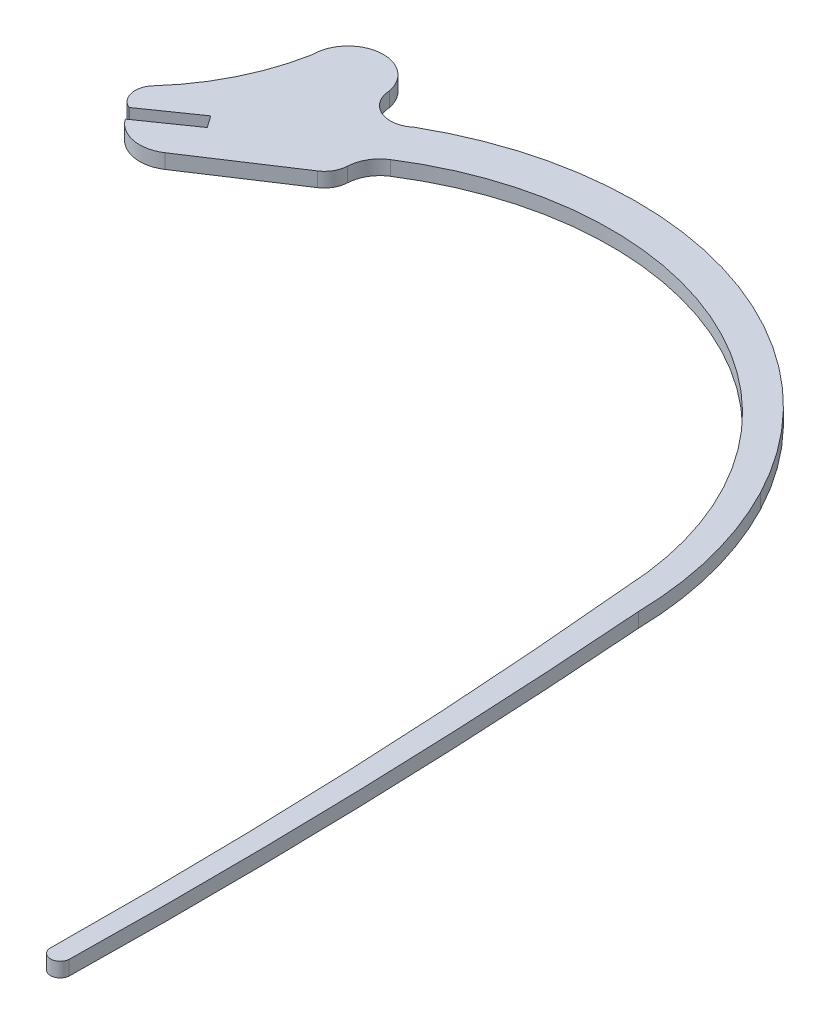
ISO-10303-21;
HEADER;
FILE_DESCRIPTION(('STEP AP214'),'2;1');
FILE_NAME('part.step','',(''),(''),'','','');
FILE_SCHEMA(('AUTOMOTIVE_DESIGN { 1 0 10303 214 1 1 1 1 }'));
ENDSEC;
DATA;
#1=APPLICATION_CONTEXT('core data for automotive mechanical design processes');
#2=APPLICATION_PROTOCOL_DEFINITION('international standard','automotive_design',2000,#1);
#3=PRODUCT_CONTEXT('',#1,'mechanical');
#4=PRODUCT('Part','Part','',(#3));
#5=PRODUCT_RELATED_PRODUCT_CATEGORY('part','',(#4));
#6=PRODUCT_DEFINITION_FORMATION('','',#4);
#7=PRODUCT_DEFINITION_CONTEXT('part definition',#1,'design');
#8=PRODUCT_DEFINITION('design','',#6,#7);
#9=PRODUCT_DEFINITION_SHAPE('','',#8);
#10=(LENGTH_UNIT() NAMED_UNIT(*) SI_UNIT(.MILLI.,.METRE.));
#11=(NAMED_UNIT(*) PLANE_ANGLE_UNIT() SI_UNIT($,.RADIAN.));
#12=(NAMED_UNIT(*) SI_UNIT($,.STERADIAN.) SOLID_ANGLE_UNIT());
#13=UNCERTAINTY_MEASURE_WITH_UNIT(LENGTH_MEASURE(1.E-05),#10,'distance_accuracy_value','');
#14=(GEOMETRIC_REPRESENTATION_CONTEXT(3) GLOBAL_UNCERTAINTY_ASSIGNED_CONTEXT((#13)) GLOBAL_UNIT_ASSIGNED_CONTEXT((#10,
#11,#12)) REPRESENTATION_CONTEXT('',''));
#15=CARTESIAN_POINT('',(0.,0.,0.));
#16=DIRECTION('',(0.,0.,1.));
#17=DIRECTION('',(1.,0.,0.));
#18=AXIS2_PLACEMENT_3D('',#15,#16,#17);
#19=CARTESIAN_POINT('',(-41890.0776006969,3.,-18429.1678708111));
#20=DIRECTION('',(0.,-1.,0.));
#21=DIRECTION('',(0.,0.,-1.));
#22=AXIS2_PLACEMENT_3D('',#19,#20,#21);
#23=CYLINDRICAL_SURFACE('',#22,7.45792893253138);
#24=CARTESIAN_POINT('',(-41890.0776006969,0.,-18429.1678708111));
#25=DIRECTION('',(0.,1.,0.));
#26=DIRECTION('',(0.,0.,1.));
#27=AXIS2_PLACEMENT_3D('',#24,#25,#26);
#28=CIRCLE('',#27,7.45792893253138);
#29=CARTESIAN_POINT('',(-41896.148437,0.,-18424.835937));
#30=VERTEX_POINT('',#29);
#31=CARTESIAN_POINT('',(-41885.984375,0.,-18422.933594));
#32=VERTEX_POINT('',#31);
#33=EDGE_CURVE('E186',#30,#32,#28,.T.);
#34=ORIENTED_EDGE('',*,*,#33,.T.);
#35=DIRECTION('',(0.,-1.,0.));
#36=VECTOR('',#35,1.);
#37=CARTESIAN_POINT('',(-41885.984375,3.,-18422.933594));
#38=LINE('',#37,#36);
#39=CARTESIAN_POINT('',(-41885.984375,3.,-18422.933594));
#40=VERTEX_POINT('',#39);
#41=EDGE_CURVE('E11',#40,#32,#38,.T.);
#42=ORIENTED_EDGE('',*,*,#41,.F.);
#43=CARTESIAN_POINT('',(-41890.0776006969,3.,-18429.1678708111));
#44=DIRECTION('',(0.,1.,0.));
#45=DIRECTION('',(0.,0.,1.));
#46=AXIS2_PLACEMENT_3D('',#43,#44,#45);
#47=CIRCLE('',#46,7.45792893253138);
#48=CARTESIAN_POINT('',(-41896.148437,3.,-18424.835937));
#49=VERTEX_POINT('',#48);
#50=EDGE_CURVE('E218',#49,#40,#47,.T.);
#51=ORIENTED_EDGE('',*,*,#50,.F.);
#52=DIRECTION('',(0.,-1.,0.));
#53=VECTOR('',#52,1.);
#54=CARTESIAN_POINT('',(-41896.148437,3.,-18424.835937));
#55=LINE('',#54,#53);
#56=EDGE_CURVE('E182',#49,#30,#55,.T.);
#57=ORIENTED_EDGE('',*,*,#56,.T.);
#58=EDGE_LOOP('',(#34,#42,#51,#57));
#59=FACE_BOUND('',#58,.T.);
#60=ADVANCED_FACE('F36',(#59),#23,.T.);
#61=CARTESIAN_POINT('',(-41866.9795919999,3.,-18435.427652));
#62=DIRECTION('',(-0.549337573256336,0.,-0.835600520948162));
#63=DIRECTION('',(-0.835600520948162,0.,0.549337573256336));
#64=AXIS2_PLACEMENT_3D('',#61,#62,#63);
#65=PLANE('',#64);
#66=DIRECTION('',(0.835600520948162,0.,-0.549337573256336));
#67=VECTOR('',#66,1.);
#68=CARTESIAN_POINT('',(-41866.9795919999,0.,-18435.427652));
#69=LINE('',#68,#67);
#70=CARTESIAN_POINT('',(-41866.979592,0.,-18435.427652));
#71=VERTEX_POINT('',#70);
#72=EDGE_CURVE('E189',#32,#71,#69,.T.);
#73=ORIENTED_EDGE('',*,*,#72,.T.);
#74=DIRECTION('',(0.,-1.,0.));
#75=VECTOR('',#74,1.);
#76=CARTESIAN_POINT('',(-41866.979592,3.,-18435.427652));
#77=LINE('',#76,#75);
#78=CARTESIAN_POINT('',(-41866.979592,3.,-18435.427652));
#79=VERTEX_POINT('',#78);
#80=EDGE_CURVE('E44',#79,#71,#77,.T.);
#81=ORIENTED_EDGE('',*,*,#80,.F.);
#82=DIRECTION('',(0.835600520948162,0.,-0.549337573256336));
#83=VECTOR('',#82,1.);
#84=CARTESIAN_POINT('',(-41866.9795919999,3.,-18435.427652));
#85=LINE('',#84,#83);
#86=EDGE_CURVE('E122',#40,#79,#85,.T.);
#87=ORIENTED_EDGE('',*,*,#86,.F.);
#88=ORIENTED_EDGE('',*,*,#41,.T.);
#89=EDGE_LOOP('',(#73,#81,#87,#88));
#90=FACE_BOUND('',#89,.T.);
#91=ADVANCED_FACE('F321',(#90),#65,.F.);
#92=CARTESIAN_POINT('',(-41869.7257293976,3.,-18439.6069290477));
#93=DIRECTION('',(0.,-1.,0.));
#94=DIRECTION('',(0.,0.,-1.));
#95=AXIS2_PLACEMENT_3D('',#92,#93,#94);
#96=CYLINDRICAL_SURFACE('',#95,5.00076266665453);
#97=CARTESIAN_POINT('',(-41869.7257293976,0.,-18439.6069290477));
#98=DIRECTION('',(0.,1.,0.));
#99=DIRECTION('',(0.,0.,1.));
#100=AXIS2_PLACEMENT_3D('',#97,#98,#99);
#101=CIRCLE('',#100,5.00076266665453);
#102=CARTESIAN_POINT('',(-41864.730505,0.,-18439.371641));
#103=VERTEX_POINT('',#102);
#104=EDGE_CURVE('E191',#71,#103,#101,.T.);
#105=ORIENTED_EDGE('',*,*,#104,.T.);
#106=DIRECTION('',(0.,-1.,0.));
#107=VECTOR('',#106,1.);
#108=CARTESIAN_POINT('',(-41864.730505,3.,-18439.371641));
#109=LINE('',#108,#107);
#110=CARTESIAN_POINT('',(-41864.730505,3.,-18439.371641));
#111=VERTEX_POINT('',#110);
#112=EDGE_CURVE('E252',#111,#103,#109,.T.);
#113=ORIENTED_EDGE('',*,*,#112,.F.);
#114=CARTESIAN_POINT('',(-41869.7257293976,3.,-18439.6069290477));
#115=DIRECTION('',(0.,1.,0.));
#116=DIRECTION('',(0.,0.,1.));
#117=AXIS2_PLACEMENT_3D('',#114,#115,#116);
#118=CIRCLE('',#117,5.00076266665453);
#119=EDGE_CURVE('E260',#79,#111,#118,.T.);
#120=ORIENTED_EDGE('',*,*,#119,.F.);
#121=ORIENTED_EDGE('',*,*,#80,.T.);
#122=EDGE_LOOP('',(#105,#113,#120,#121));
#123=FACE_BOUND('',#122,.T.);
#124=ADVANCED_FACE('F258',(#123),#96,.T.);
#125=CARTESIAN_POINT('',(-41857.6633660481,3.,-18439.0441717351));
#126=DIRECTION('',(0.,-1.,0.));
#127=DIRECTION('',(0.,0.,-1.));
#128=AXIS2_PLACEMENT_3D('',#125,#126,#127);
#129=CYLINDRICAL_SURFACE('',#128,7.07472183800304);
#130=CARTESIAN_POINT('',(-41857.6633660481,0.,-18439.0441717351));
#131=DIRECTION('',(0.,-1.,0.));
#132=DIRECTION('',(0.,0.,1.));
#133=AXIS2_PLACEMENT_3D('',#130,#131,#132);
#134=CIRCLE('',#133,7.07472183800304);
#135=CARTESIAN_POINT('',(-41861.4689960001,0.,-18445.008136));
#136=VERTEX_POINT('',#135);
#137=EDGE_CURVE('E193',#103,#136,#134,.T.);
#138=ORIENTED_EDGE('',*,*,#137,.T.);
#139=DIRECTION('',(0.,-1.,0.));
#140=VECTOR('',#139,1.);
#141=CARTESIAN_POINT('',(-41861.4689960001,3.,-18445.008136));
#142=LINE('',#141,#140);
#143=CARTESIAN_POINT('',(-41861.4689960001,3.,-18445.008136));
#144=VERTEX_POINT('',#143);
#145=EDGE_CURVE('E249',#144,#136,#142,.T.);
#146=ORIENTED_EDGE('',*,*,#145,.F.);
#147=CARTESIAN_POINT('',(-41857.6633660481,3.,-18439.0441717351));
#148=DIRECTION('',(0.,-1.,0.));
#149=DIRECTION('',(0.,0.,1.));
#150=AXIS2_PLACEMENT_3D('',#147,#148,#149);
#151=CIRCLE('',#150,7.07472183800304);
#152=EDGE_CURVE('E278',#111,#144,#151,.T.);
#153=ORIENTED_EDGE('',*,*,#152,.F.);
#154=ORIENTED_EDGE('',*,*,#112,.T.);
#155=EDGE_LOOP('',(#138,#146,#153,#154));
#156=FACE_BOUND('',#155,.T.);
#157=ADVANCED_FACE('F269',(#156),#129,.F.);
#158=CARTESIAN_POINT('',(-41826.1250165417,3.,-18389.6015705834));
#159=DIRECTION('',(0.,-1.,0.));
#160=DIRECTION('',(0.,0.,-1.));
#161=AXIS2_PLACEMENT_3D('',#158,#159,#160);
#162=CYLINDRICAL_SURFACE('',#161,65.719741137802);
#163=CARTESIAN_POINT('',(-41826.1250165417,0.,-18389.6015705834));
#164=DIRECTION('',(0.,-1.,0.));
#165=DIRECTION('',(0.,0.,1.));
#166=AXIS2_PLACEMENT_3D('',#163,#164,#165);
#167=CIRCLE('',#166,65.719741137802);
#168=CARTESIAN_POINT('',(-41760.4738210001,0.,-18392.6023870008));
#169=VERTEX_POINT('',#168);
#170=EDGE_CURVE('E195',#136,#169,#167,.T.);
#171=ORIENTED_EDGE('',*,*,#170,.T.);
#172=DIRECTION('',(0.,-1.,0.));
#173=VECTOR('',#172,1.);
#174=CARTESIAN_POINT('',(-41760.4738210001,3.,-18392.6023870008));
#175=LINE('',#174,#173);
#176=CARTESIAN_POINT('',(-41760.4738210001,3.,-18392.6023870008));
#177=VERTEX_POINT('',#176);
#178=EDGE_CURVE('E246',#177,#169,#175,.T.);
#179=ORIENTED_EDGE('',*,*,#178,.F.);
#180=CARTESIAN_POINT('',(-41826.1250165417,3.,-18389.6015705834));
#181=DIRECTION('',(0.,-1.,0.));
#182=DIRECTION('',(0.,0.,1.));
#183=AXIS2_PLACEMENT_3D('',#180,#181,#182);
#184=CIRCLE('',#183,65.719741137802);
#185=EDGE_CURVE('E275',#144,#177,#184,.T.);
#186=ORIENTED_EDGE('',*,*,#185,.F.);
#187=ORIENTED_EDGE('',*,*,#145,.T.);
#188=EDGE_LOOP('',(#171,#179,#186,#187));
#189=FACE_BOUND('',#188,.T.);
#190=ADVANCED_FACE('F273',(#189),#162,.F.);
#191=CARTESIAN_POINT('',(-42916.2538828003,3.,-18282.8705311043));
#192=DIRECTION('',(0.,-1.,0.));
#193=DIRECTION('',(0.,0.,-1.));
#194=AXIS2_PLACEMENT_3D('',#191,#192,#193);
#195=CYLINDRICAL_SURFACE('',#194,1160.977446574);
#196=CARTESIAN_POINT('',(-42916.2538828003,0.,-18282.8705311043));
#197=DIRECTION('',(0.,-1.,0.));
#198=DIRECTION('',(0.,0.,1.));
#199=AXIS2_PLACEMENT_3D('',#196,#197,#198);
#200=CIRCLE('',#199,1160.977446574);
#201=CARTESIAN_POINT('',(-41755.363965,0.,-18268.614648));
#202=VERTEX_POINT('',#201);
#203=EDGE_CURVE('E197',#169,#202,#200,.T.);
#204=ORIENTED_EDGE('',*,*,#203,.T.);
#205=DIRECTION('',(0.,-1.,0.));
#206=VECTOR('',#205,1.);
#207=CARTESIAN_POINT('',(-41755.363965,3.,-18268.614648));
#208=LINE('',#207,#206);
#209=CARTESIAN_POINT('',(-41755.363965,3.,-18268.614648));
#210=VERTEX_POINT('',#209);
#211=EDGE_CURVE('E243',#210,#202,#208,.T.);
#212=ORIENTED_EDGE('',*,*,#211,.F.);
#213=CARTESIAN_POINT('',(-42916.2538828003,3.,-18282.8705311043));
#214=DIRECTION('',(0.,-1.,0.));
#215=DIRECTION('',(0.,0.,1.));
#216=AXIS2_PLACEMENT_3D('',#213,#214,#215);
#217=CIRCLE('',#216,1160.977446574);
#218=EDGE_CURVE('E277',#177,#210,#217,.T.);
#219=ORIENTED_EDGE('',*,*,#218,.F.);
#220=ORIENTED_EDGE('',*,*,#178,.T.);
#221=EDGE_LOOP('',(#204,#212,#219,#220));
#222=FACE_BOUND('',#221,.T.);
#223=ADVANCED_FACE('F334',(#222),#195,.F.);
#224=CARTESIAN_POINT('',(-41753.3663240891,3.,-18268.5898071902));
#225=DIRECTION('',(0.,-1.,0.));
#226=DIRECTION('',(0.,0.,-1.));
#227=AXIS2_PLACEMENT_3D('',#224,#225,#226);
#228=CYLINDRICAL_SURFACE('',#227,1.99779535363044);
#229=CARTESIAN_POINT('',(-41753.3663240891,0.,-18268.5898071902));
#230=DIRECTION('',(0.,1.,0.));
#231=DIRECTION('',(0.,0.,1.));
#232=AXIS2_PLACEMENT_3D('',#229,#230,#231);
#233=CIRCLE('',#232,1.99779535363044);
#234=CARTESIAN_POINT('',(-41751.373825,0.,-18268.444433));
#235=VERTEX_POINT('',#234);
#236=EDGE_CURVE('E199',#202,#235,#233,.T.);
#237=ORIENTED_EDGE('',*,*,#236,.T.);
#238=DIRECTION('',(0.,-1.,0.));
#239=VECTOR('',#238,1.);
#240=CARTESIAN_POINT('',(-41751.373825,3.,-18268.444433));
#241=LINE('',#240,#239);
#242=CARTESIAN_POINT('',(-41751.373825,3.,-18268.444433));
#243=VERTEX_POINT('',#242);
#244=EDGE_CURVE('E240',#243,#235,#241,.T.);
#245=ORIENTED_EDGE('',*,*,#244,.F.);
#246=CARTESIAN_POINT('',(-41753.3663240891,3.,-18268.5898071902));
#247=DIRECTION('',(0.,1.,0.));
#248=DIRECTION('',(0.,0.,1.));
#249=AXIS2_PLACEMENT_3D('',#246,#247,#248);
#250=CIRCLE('',#249,1.99779535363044);
#251=EDGE_CURVE('E280',#210,#243,#250,.T.);
#252=ORIENTED_EDGE('',*,*,#251,.F.);
#253=ORIENTED_EDGE('',*,*,#211,.T.);
#254=EDGE_LOOP('',(#237,#245,#252,#253));
#255=FACE_BOUND('',#254,.T.);
#256=ADVANCED_FACE('F337',(#255),#228,.T.);
#257=CARTESIAN_POINT('',(-43051.2068226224,3.,-18292.3207608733));
#258=DIRECTION('',(0.,-1.,0.));
#259=DIRECTION('',(0.,0.,-1.));
#260=AXIS2_PLACEMENT_3D('',#257,#258,#259);
#261=CYLINDRICAL_SURFACE('',#260,1300.0522684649);
#262=CARTESIAN_POINT('',(-43051.2068226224,0.,-18292.3207608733));
#263=DIRECTION('',(0.,1.,0.));
#264=DIRECTION('',(0.,0.,1.));
#265=AXIS2_PLACEMENT_3D('',#262,#263,#264);
#266=CIRCLE('',#265,1300.0522684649);
#267=CARTESIAN_POINT('',(-41754.803806,0.,-18389.6609850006));
#268=VERTEX_POINT('',#267);
#269=EDGE_CURVE('E201',#235,#268,#266,.T.);
#270=ORIENTED_EDGE('',*,*,#269,.T.);
#271=DIRECTION('',(0.,-1.,0.));
#272=VECTOR('',#271,1.);
#273=CARTESIAN_POINT('',(-41754.803806,3.,-18389.6609850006));
#274=LINE('',#273,#272);
#275=CARTESIAN_POINT('',(-41754.803806,3.,-18389.6609850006));
#276=VERTEX_POINT('',#275);
#277=EDGE_CURVE('E237',#276,#268,#274,.T.);
#278=ORIENTED_EDGE('',*,*,#277,.F.);
#279=CARTESIAN_POINT('',(-43051.2068226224,3.,-18292.3207608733));
#280=DIRECTION('',(0.,1.,0.));
#281=DIRECTION('',(0.,0.,1.));
#282=AXIS2_PLACEMENT_3D('',#279,#280,#281);
#283=CIRCLE('',#282,1300.0522684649);
#284=EDGE_CURVE('E286',#243,#276,#283,.T.);
#285=ORIENTED_EDGE('',*,*,#284,.F.);
#286=ORIENTED_EDGE('',*,*,#244,.T.);
#287=EDGE_LOOP('',(#270,#278,#285,#286));
#288=FACE_BOUND('',#287,.T.);
#289=ADVANCED_FACE('F341',(#288),#261,.T.);
#290=CARTESIAN_POINT('',(-41831.1839195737,3.,-18388.2297942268));
#291=DIRECTION('',(0.,-1.,0.));
#292=DIRECTION('',(0.,0.,-1.));
#293=AXIS2_PLACEMENT_3D('',#290,#291,#292);
#294=CYLINDRICAL_SURFACE('',#293,76.3935210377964);
#295=CARTESIAN_POINT('',(-41831.1839195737,0.,-18388.2297942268));
#296=DIRECTION('',(0.,1.,0.));
#297=DIRECTION('',(0.,0.,1.));
#298=AXIS2_PLACEMENT_3D('',#295,#296,#297);
#299=CIRCLE('',#298,76.3935210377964);
#300=CARTESIAN_POINT('',(-41763.425823,0.,-18423.511665));
#301=VERTEX_POINT('',#300);
#302=EDGE_CURVE('E203',#268,#301,#299,.T.);
#303=ORIENTED_EDGE('',*,*,#302,.T.);
#304=DIRECTION('',(0.,-1.,0.));
#305=VECTOR('',#304,1.);
#306=CARTESIAN_POINT('',(-41763.425823,3.,-18423.511665));
#307=LINE('',#306,#305);
#308=CARTESIAN_POINT('',(-41763.425823,3.,-18423.511665));
#309=VERTEX_POINT('',#308);
#310=EDGE_CURVE('E234',#309,#301,#307,.T.);
#311=ORIENTED_EDGE('',*,*,#310,.F.);
#312=CARTESIAN_POINT('',(-41831.1839195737,3.,-18388.2297942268));
#313=DIRECTION('',(0.,1.,0.));
#314=DIRECTION('',(0.,0.,1.));
#315=AXIS2_PLACEMENT_3D('',#312,#313,#314);
#316=CIRCLE('',#315,76.3935210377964);
#317=EDGE_CURVE('E288',#276,#309,#316,.T.);
#318=ORIENTED_EDGE('',*,*,#317,.F.);
#319=ORIENTED_EDGE('',*,*,#277,.T.);
#320=EDGE_LOOP('',(#303,#311,#318,#319));
#321=FACE_BOUND('',#320,.T.);
#322=ADVANCED_FACE('F345',(#321),#294,.T.);
#323=CARTESIAN_POINT('',(-41828.4170991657,3.,-18389.6696663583));
#324=DIRECTION('',(0.,-1.,0.));
#325=DIRECTION('',(0.,0.,-1.));
#326=AXIS2_PLACEMENT_3D('',#323,#324,#325);
#327=CYLINDRICAL_SURFACE('',#326,73.2744624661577);
#328=CARTESIAN_POINT('',(-41828.4170991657,0.,-18389.6696663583));
#329=DIRECTION('',(0.,1.,0.));
#330=DIRECTION('',(0.,0.,1.));
#331=AXIS2_PLACEMENT_3D('',#328,#329,#330);
#332=CIRCLE('',#331,73.2744624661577);
#333=CARTESIAN_POINT('',(-41864.763185,0.,-18453.294417));
#334=VERTEX_POINT('',#333);
#335=EDGE_CURVE('E205',#301,#334,#332,.T.);
#336=ORIENTED_EDGE('',*,*,#335,.T.);
#337=DIRECTION('',(0.,-1.,0.));
#338=VECTOR('',#337,1.);
#339=CARTESIAN_POINT('',(-41864.763185,3.,-18453.294417));
#340=LINE('',#339,#338);
#341=CARTESIAN_POINT('',(-41864.763185,3.,-18453.294417));
#342=VERTEX_POINT('',#341);
#343=EDGE_CURVE('E231',#342,#334,#340,.T.);
#344=ORIENTED_EDGE('',*,*,#343,.F.);
#345=CARTESIAN_POINT('',(-41828.4170991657,3.,-18389.6696663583));
#346=DIRECTION('',(0.,1.,0.));
#347=DIRECTION('',(0.,0.,1.));
#348=AXIS2_PLACEMENT_3D('',#345,#346,#347);
#349=CIRCLE('',#348,73.2744624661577);
#350=EDGE_CURVE('E290',#309,#342,#349,.T.);
#351=ORIENTED_EDGE('',*,*,#350,.F.);
#352=ORIENTED_EDGE('',*,*,#310,.T.);
#353=EDGE_LOOP('',(#336,#344,#351,#352));
#354=FACE_BOUND('',#353,.T.);
#355=ADVANCED_FACE('F349',(#354),#327,.T.);
#356=CARTESIAN_POINT('',(-41868.3822196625,3.,-18457.4235716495));
#357=DIRECTION('',(0.,-1.,0.));
#358=DIRECTION('',(0.,0.,-1.));
#359=AXIS2_PLACEMENT_3D('',#356,#357,#358);
#360=CYLINDRICAL_SURFACE('',#359,5.49065843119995);
#361=CARTESIAN_POINT('',(-41868.3822196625,0.,-18457.4235716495));
#362=DIRECTION('',(0.,-1.,0.));
#363=DIRECTION('',(0.,0.,1.));
#364=AXIS2_PLACEMENT_3D('',#361,#362,#363);
#365=CIRCLE('',#364,5.49065843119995);
#366=CARTESIAN_POINT('',(-41873.8696560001,0.,-18457.235496));
#367=VERTEX_POINT('',#366);
#368=EDGE_CURVE('E207',#334,#367,#365,.T.);
#369=ORIENTED_EDGE('',*,*,#368,.T.);
#370=DIRECTION('',(0.,-1.,0.));
#371=VECTOR('',#370,1.);
#372=CARTESIAN_POINT('',(-41873.8696560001,3.,-18457.235496));
#373=LINE('',#372,#371);
#374=CARTESIAN_POINT('',(-41873.8696560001,3.,-18457.235496));
#375=VERTEX_POINT('',#374);
#376=EDGE_CURVE('E228',#375,#367,#373,.T.);
#377=ORIENTED_EDGE('',*,*,#376,.F.);
#378=CARTESIAN_POINT('',(-41868.3822196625,3.,-18457.4235716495));
#379=DIRECTION('',(0.,-1.,0.));
#380=DIRECTION('',(0.,0.,1.));
#381=AXIS2_PLACEMENT_3D('',#378,#379,#380);
#382=CIRCLE('',#381,5.49065843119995);
#383=EDGE_CURVE('E292',#342,#375,#382,.T.);
#384=ORIENTED_EDGE('',*,*,#383,.F.);
#385=ORIENTED_EDGE('',*,*,#343,.T.);
#386=EDGE_LOOP('',(#369,#377,#384,#385));
#387=FACE_BOUND('',#386,.T.);
#388=ADVANCED_FACE('F353',(#387),#360,.F.);
#389=CARTESIAN_POINT('',(-41881.0396504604,3.,-18455.818296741));
#390=DIRECTION('',(0.,-1.,0.));
#391=DIRECTION('',(0.,0.,-1.));
#392=AXIS2_PLACEMENT_3D('',#389,#390,#391);
#393=CYLINDRICAL_SURFACE('',#392,7.30871221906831);
#394=CARTESIAN_POINT('',(-41881.0396504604,0.,-18455.818296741));
#395=DIRECTION('',(0.,1.,0.));
#396=DIRECTION('',(0.,0.,1.));
#397=AXIS2_PLACEMENT_3D('',#394,#395,#396);
#398=CIRCLE('',#397,7.30871221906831);
#399=CARTESIAN_POINT('',(-41888.347465,0.,-18455.70375));
#400=VERTEX_POINT('',#399);
#401=EDGE_CURVE('E209',#367,#400,#398,.T.);
#402=ORIENTED_EDGE('',*,*,#401,.T.);
#403=DIRECTION('',(0.,-1.,0.));
#404=VECTOR('',#403,1.);
#405=CARTESIAN_POINT('',(-41888.347465,3.,-18455.70375));
#406=LINE('',#405,#404);
#407=CARTESIAN_POINT('',(-41888.347465,3.,-18455.70375));
#408=VERTEX_POINT('',#407);
#409=EDGE_CURVE('E225',#408,#400,#406,.T.);
#410=ORIENTED_EDGE('',*,*,#409,.F.);
#411=CARTESIAN_POINT('',(-41881.0396504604,3.,-18455.818296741));
#412=DIRECTION('',(0.,1.,0.));
#413=DIRECTION('',(0.,0.,1.));
#414=AXIS2_PLACEMENT_3D('',#411,#412,#413);
#415=CIRCLE('',#414,7.30871221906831);
#416=EDGE_CURVE('E294',#375,#408,#415,.T.);
#417=ORIENTED_EDGE('',*,*,#416,.F.);
#418=ORIENTED_EDGE('',*,*,#376,.T.);
#419=EDGE_LOOP('',(#402,#410,#417,#418));
#420=FACE_BOUND('',#419,.T.);
#421=ADVANCED_FACE('F357',(#420),#393,.T.);
#422=CARTESIAN_POINT('',(-41932.8469967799,3.,-18463.983751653));
#423=DIRECTION('',(0.,-1.,0.));
#424=DIRECTION('',(0.,0.,-1.));
#425=AXIS2_PLACEMENT_3D('',#422,#423,#424);
#426=CYLINDRICAL_SURFACE('',#425,45.2633047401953);
#427=CARTESIAN_POINT('',(-41932.8469967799,0.,-18463.983751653));
#428=DIRECTION('',(0.,-1.,0.));
#429=DIRECTION('',(0.,0.,1.));
#430=AXIS2_PLACEMENT_3D('',#427,#428,#429);
#431=CIRCLE('',#430,45.2633047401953);
#432=CARTESIAN_POINT('',(-41899.317041,0.,-18433.578015));
#433=VERTEX_POINT('',#432);
#434=EDGE_CURVE('E211',#400,#433,#431,.T.);
#435=ORIENTED_EDGE('',*,*,#434,.T.);
#436=DIRECTION('',(0.,-1.,0.));
#437=VECTOR('',#436,1.);
#438=CARTESIAN_POINT('',(-41899.317041,3.,-18433.578015));
#439=LINE('',#438,#437);
#440=CARTESIAN_POINT('',(-41899.317041,3.,-18433.578015));
#441=VERTEX_POINT('',#440);
#442=EDGE_CURVE('E222',#441,#433,#439,.T.);
#443=ORIENTED_EDGE('',*,*,#442,.F.);
#444=CARTESIAN_POINT('',(-41932.8469967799,3.,-18463.983751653));
#445=DIRECTION('',(0.,-1.,0.));
#446=DIRECTION('',(0.,0.,1.));
#447=AXIS2_PLACEMENT_3D('',#444,#445,#446);
#448=CIRCLE('',#447,45.2633047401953);
#449=EDGE_CURVE('E296',#408,#441,#448,.T.);
#450=ORIENTED_EDGE('',*,*,#449,.F.);
#451=ORIENTED_EDGE('',*,*,#409,.T.);
#452=EDGE_LOOP('',(#435,#443,#450,#451));
#453=FACE_BOUND('',#452,.T.);
#454=ADVANCED_FACE('F302',(#453),#426,.F.);
#455=CARTESIAN_POINT('',(-41896.2228812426,3.,-18430.9853481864));
#456=DIRECTION('',(0.,-1.,0.));
#457=DIRECTION('',(0.,0.,-1.));
#458=AXIS2_PLACEMENT_3D('',#455,#456,#457);
#459=CYLINDRICAL_SURFACE('',#458,4.03679895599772);
#460=CARTESIAN_POINT('',(-41896.2228812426,0.,-18430.9853481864));
#461=DIRECTION('',(0.,1.,0.));
#462=DIRECTION('',(0.,0.,1.));
#463=AXIS2_PLACEMENT_3D('',#460,#461,#462);
#464=CIRCLE('',#463,4.03679895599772);
#465=CARTESIAN_POINT('',(-41897.863281,0.,-18427.296875));
#466=VERTEX_POINT('',#465);
#467=EDGE_CURVE('E213',#433,#466,#464,.T.);
#468=ORIENTED_EDGE('',*,*,#467,.T.);
#469=DIRECTION('',(0.,-1.,0.));
#470=VECTOR('',#469,1.);
#471=CARTESIAN_POINT('',(-41897.863281,3.,-18427.296875));
#472=LINE('',#471,#470);
#473=CARTESIAN_POINT('',(-41897.863281,3.,-18427.296875));
#474=VERTEX_POINT('',#473);
#475=EDGE_CURVE('E177',#474,#466,#472,.T.);
#476=ORIENTED_EDGE('',*,*,#475,.F.);
#477=CARTESIAN_POINT('',(-41896.2228812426,3.,-18430.9853481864));
#478=DIRECTION('',(0.,1.,0.));
#479=DIRECTION('',(0.,0.,1.));
#480=AXIS2_PLACEMENT_3D('',#477,#478,#479);
#481=CIRCLE('',#480,4.03679895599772);
#482=EDGE_CURVE('E168',#441,#474,#481,.T.);
#483=ORIENTED_EDGE('',*,*,#482,.F.);
#484=ORIENTED_EDGE('',*,*,#442,.T.);
#485=EDGE_LOOP('',(#468,#476,#483,#484));
#486=FACE_BOUND('',#485,.T.);
#487=ADVANCED_FACE('F306',(#486),#459,.T.);
#488=CARTESIAN_POINT('',(-41887.871094,3.,-18434.255859));
#489=DIRECTION('',(-0.571501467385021,0.,-0.820601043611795));
#490=DIRECTION('',(-0.820601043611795,0.,0.571501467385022));
#491=AXIS2_PLACEMENT_3D('',#488,#489,#490);
#492=PLANE('',#491);
#493=DIRECTION('',(0.820601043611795,0.,-0.571501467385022));
#494=VECTOR('',#493,1.);
#495=CARTESIAN_POINT('',(-41887.871094,0.,-18434.255859));
#496=LINE('',#495,#494);
#497=CARTESIAN_POINT('',(-41887.871094,0.,-18434.255859));
#498=VERTEX_POINT('',#497);
#499=EDGE_CURVE('E176',#466,#498,#496,.T.);
#500=ORIENTED_EDGE('',*,*,#499,.T.);
#501=DIRECTION('',(0.,-1.,0.));
#502=VECTOR('',#501,1.);
#503=CARTESIAN_POINT('',(-41887.871094,3.,-18434.255859));
#504=LINE('',#503,#502);
#505=CARTESIAN_POINT('',(-41887.871094,3.,-18434.255859));
#506=VERTEX_POINT('',#505);
#507=EDGE_CURVE('E173',#506,#498,#504,.T.);
#508=ORIENTED_EDGE('',*,*,#507,.F.);
#509=DIRECTION('',(0.820601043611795,0.,-0.571501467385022));
#510=VECTOR('',#509,1.);
#511=CARTESIAN_POINT('',(-41887.871094,3.,-18434.255859));
#512=LINE('',#511,#510);
#513=EDGE_CURVE('E162',#474,#506,#512,.T.);
#514=ORIENTED_EDGE('',*,*,#513,.F.);
#515=ORIENTED_EDGE('',*,*,#475,.T.);
#516=EDGE_LOOP('',(#500,#508,#514,#515));
#517=FACE_BOUND('',#516,.T.);
#518=ADVANCED_FACE('F174',(#517),#492,.F.);
#519=CARTESIAN_POINT('',(-41886.15625,3.,-18431.794922));
#520=DIRECTION('',(0.820453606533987,0.,-0.571713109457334));
#521=DIRECTION('',(-0.571713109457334,0.,-0.820453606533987));
#522=AXIS2_PLACEMENT_3D('',#519,#520,#521);
#523=PLANE('',#522);
#524=DIRECTION('',(0.571713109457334,0.,0.820453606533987));
#525=VECTOR('',#524,1.);
#526=CARTESIAN_POINT('',(-41886.15625,0.,-18431.794922));
#527=LINE('',#526,#525);
#528=CARTESIAN_POINT('',(-41886.15625,0.,-18431.794922));
#529=VERTEX_POINT('',#528);
#530=EDGE_CURVE('E108',#498,#529,#527,.T.);
#531=ORIENTED_EDGE('',*,*,#530,.T.);
#532=DIRECTION('',(0.,-1.,0.));
#533=VECTOR('',#532,1.);
#534=CARTESIAN_POINT('',(-41886.15625,3.,-18431.794922));
#535=LINE('',#534,#533);
#536=CARTESIAN_POINT('',(-41886.15625,3.,-18431.794922));
#537=VERTEX_POINT('',#536);
#538=EDGE_CURVE('E178',#537,#529,#535,.T.);
#539=ORIENTED_EDGE('',*,*,#538,.F.);
#540=DIRECTION('',(0.571713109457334,0.,0.820453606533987));
#541=VECTOR('',#540,1.);
#542=CARTESIAN_POINT('',(-41886.15625,3.,-18431.794922));
#543=LINE('',#542,#541);
#544=EDGE_CURVE('E166',#506,#537,#543,.T.);
#545=ORIENTED_EDGE('',*,*,#544,.F.);
#546=ORIENTED_EDGE('',*,*,#507,.T.);
#547=EDGE_LOOP('',(#531,#539,#545,#546));
#548=FACE_BOUND('',#547,.T.);
#549=ADVANCED_FACE('F180',(#548),#523,.F.);
#550=CARTESIAN_POINT('',(-41896.148437,3.,-18424.835937));
#551=DIRECTION('',(0.571501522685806,0.,0.820601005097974));
#552=DIRECTION('',(0.820601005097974,0.,-0.571501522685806));
#553=AXIS2_PLACEMENT_3D('',#550,#551,#552);
#554=PLANE('',#553);
#555=DIRECTION('',(-0.820601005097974,0.,0.571501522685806));
#556=VECTOR('',#555,1.);
#557=CARTESIAN_POINT('',(-41896.148437,0.,-18424.835937));
#558=LINE('',#557,#556);
#559=EDGE_CURVE('E114',#529,#30,#558,.T.);
#560=ORIENTED_EDGE('',*,*,#559,.T.);
#561=ORIENTED_EDGE('',*,*,#56,.F.);
#562=DIRECTION('',(-0.820601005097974,0.,0.571501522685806));
#563=VECTOR('',#562,1.);
#564=CARTESIAN_POINT('',(-41896.148437,3.,-18424.835937));
#565=LINE('',#564,#563);
#566=EDGE_CURVE('E52',#537,#49,#565,.T.);
#567=ORIENTED_EDGE('',*,*,#566,.F.);
#568=ORIENTED_EDGE('',*,*,#538,.T.);
#569=EDGE_LOOP('',(#560,#561,#567,#568));
#570=FACE_BOUND('',#569,.T.);
#571=ADVANCED_FACE('F310',(#570),#554,.F.);
#572=CARTESIAN_POINT('',(-41890.0776006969,3.,-18429.1678708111));
#573=DIRECTION('',(0.,1.,0.));
#574=DIRECTION('',(0.,0.,1.));
#575=AXIS2_PLACEMENT_3D('',#572,#573,#574);
#576=PLANE('',#575);
#577=ORIENTED_EDGE('',*,*,#50,.T.);
#578=ORIENTED_EDGE('',*,*,#86,.T.);
#579=ORIENTED_EDGE('',*,*,#119,.T.);
#580=ORIENTED_EDGE('',*,*,#152,.T.);
#581=ORIENTED_EDGE('',*,*,#185,.T.);
#582=ORIENTED_EDGE('',*,*,#218,.T.);
#583=ORIENTED_EDGE('',*,*,#251,.T.);
#584=ORIENTED_EDGE('',*,*,#284,.T.);
#585=ORIENTED_EDGE('',*,*,#317,.T.);
#586=ORIENTED_EDGE('',*,*,#350,.T.);
#587=ORIENTED_EDGE('',*,*,#383,.T.);
#588=ORIENTED_EDGE('',*,*,#416,.T.);
#589=ORIENTED_EDGE('',*,*,#449,.T.);
#590=ORIENTED_EDGE('',*,*,#482,.T.);
#591=ORIENTED_EDGE('',*,*,#513,.T.);
#592=ORIENTED_EDGE('',*,*,#544,.T.);
#593=ORIENTED_EDGE('',*,*,#566,.T.);
#594=EDGE_LOOP('',(#577,#578,#579,#580,#581,#582,#583,#584,#585,#586,#587,#588,#589,#590,#591,
#592,#593));
#595=FACE_BOUND('',#594,.T.);
#596=ADVANCED_FACE('F164',(#595),#576,.T.);
#597=CARTESIAN_POINT('',(-41890.0776006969,0.,-18429.1678708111));
#598=DIRECTION('',(0.,1.,0.));
#599=DIRECTION('',(0.,0.,1.));
#600=AXIS2_PLACEMENT_3D('',#597,#598,#599);
#601=PLANE('',#600);
#602=ORIENTED_EDGE('',*,*,#33,.F.);
#603=ORIENTED_EDGE('',*,*,#559,.F.);
#604=ORIENTED_EDGE('',*,*,#530,.F.);
#605=ORIENTED_EDGE('',*,*,#499,.F.);
#606=ORIENTED_EDGE('',*,*,#467,.F.);
#607=ORIENTED_EDGE('',*,*,#434,.F.);
#608=ORIENTED_EDGE('',*,*,#401,.F.);
#609=ORIENTED_EDGE('',*,*,#368,.F.);
#610=ORIENTED_EDGE('',*,*,#335,.F.);
#611=ORIENTED_EDGE('',*,*,#302,.F.);
#612=ORIENTED_EDGE('',*,*,#269,.F.);
#613=ORIENTED_EDGE('',*,*,#236,.F.);
#614=ORIENTED_EDGE('',*,*,#203,.F.);
#615=ORIENTED_EDGE('',*,*,#170,.F.);
#616=ORIENTED_EDGE('',*,*,#137,.F.);
#617=ORIENTED_EDGE('',*,*,#104,.F.);
#618=ORIENTED_EDGE('',*,*,#72,.F.);
#619=EDGE_LOOP('',(#602,#603,#604,#605,#606,#607,#608,#609,#610,#611,#612,#613,#614,#615,#616,
#617,#618));
#620=FACE_BOUND('',#619,.T.);
#621=ADVANCED_FACE('F264',(#620),#601,.F.);
#622=CLOSED_SHELL('',(#60,#91,#124,#157,#190,#223,#256,#289,#322,#355,#388,#421,#454,#487,#518,
#549,#571,#596,#621));
#623=MANIFOLD_SOLID_BREP('B2',#622);
#624=ADVANCED_BREP_SHAPE_REPRESENTATION('',(#18,#623),#14);
#625=SHAPE_DEFINITION_REPRESENTATION(#9,#624);
ENDSEC;
END-ISO-10303-21;
